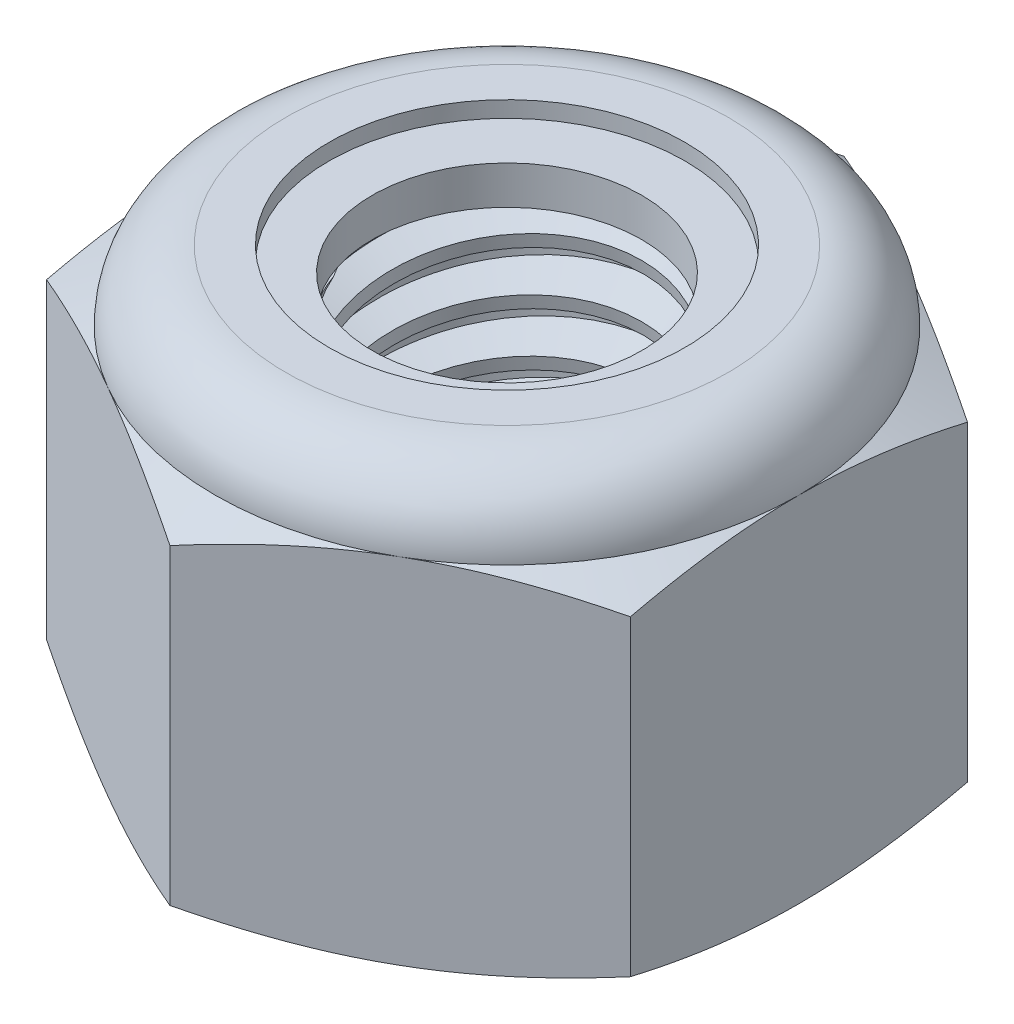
from build123d import *

# Parameters (mm, degrees)
EXTRUDE1_DEPTH      = 4
SKETCH2_W           = 1.5
SKETCH2_H           = 4
LPATTERN1_COUNT     = 8
LPATTERN1_PITCH     = 0.5
LPATTERN1_COL_COUNT = 2
LPATTERN1_COL_PITCH = 0.5


with BuildPart() as part:
    # Sketch1 → Extrude1 (new body)
    with BuildSketch(Plane(origin=(0, 0, 0), x_dir=(1, 0, 0), z_dir=(0, 1, 0))):
        Polygon((0, 3.175426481), (-2.75, 1.58771324), (-2.75, -1.58771324), (0, -3.175426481), (2.75, -1.58771324), (2.75, 1.58771324), align=None)
    extrude(amount=EXTRUDE1_DEPTH)

    # Sketch4 → Cut-Revolve2 (revolve, cut)
    with BuildSketch(Plane(origin=(0, 0, 0), x_dir=(0, 0, -1), z_dir=(1, 0, 0)), mode=Mode.PRIVATE) as cut_revolve2_sk:
        Polygon((0, 4), (1.5, 4), (1.269011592, 3.892288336), (1.269011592, 0.107711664), (1.5, 0), (0, 0), align=None)
    revolve(cut_revolve2_sk.sketch.rotate(Axis((0, 4, 0), (0, 1, 0)), 55.157981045), axis=Axis((0, 4, 0), (0, 1, 0)), mode=Mode.SUBTRACT)


with BuildPart() as body_2:
    # Sketch2 → Revolve1 (revolve)
    with BuildSketch(Plane(origin=(0, 0, 0), x_dir=(0, 0, -1), z_dir=(1, 0, 0))):
        with Locations((0.75, 2)):
            Rectangle(SKETCH2_W, SKETCH2_H)
    revolve(axis=Axis((0, -1.5, 0), (0, 1, 0)))

    # Sketch3 → Cut-Revolve1 (revolve, cut)
    with BuildSketch(Plane(origin=(0, 0, 0), x_dir=(0, 0, -1), z_dir=(1, 0, 0)), mode=Mode.PRIVATE) as cut_revolve1_sk:
        Polygon((1.510274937, 3.93835038), (1.582199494, 3.506803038), (1.289561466, 3.616435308), (1.269011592, 3.739734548), align=None)
    cut_revolve1 = revolve(cut_revolve1_sk.sketch.rotate(Axis((0, 4, 0.089188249), (0, -0.9863939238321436, -0.1643989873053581)), 180), axis=Axis((0, 4, 0.089188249), (0, -0.9863939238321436, -0.1643989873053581)), mode=Mode.SUBTRACT)

    # LPattern1: Cut-Revolve1 ×8
    with Locations(*[(0, -i * LPATTERN1_PITCH, 0) for i in range(1, LPATTERN1_COUNT)]):
        add(cut_revolve1, mode=Mode.SUBTRACT)

    # LPattern1 col: Cut-Revolve1 ×2
    with Locations(*[(0, i * LPATTERN1_COL_PITCH, 0) for i in range(1, LPATTERN1_COL_COUNT)]):
        add(cut_revolve1, mode=Mode.SUBTRACT)


with BuildPart() as part_1:
    add(part.part)

    # Combine1: cut body 2
    add(body_2.part, mode=Mode.SUBTRACT)

    # Sketch5 → Cut-Revolve3 (revolve, cut)
    with BuildSketch(Plane(origin=(0, 0, 0), x_dir=(0, 0, -1), z_dir=(1, 0, 0)), mode=Mode.PRIVATE) as cut_revolve3_sk:
        with BuildLine():
            Line((0, 0), (2.75, 0))
            Line((2.75, 0), (3.175426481, 0.198379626))
            Line((3.175426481, 0.198379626), (3.175426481, 3.134953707))
            Line((3.175426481, 3.134953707), (2.75, 3.333333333))
            ThreePointArc((2.75, 3.333333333), (2.554737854, 3.804737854), (2.083333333, 4))
            Line((2.083333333, 4), (2.083333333, 5.27))
            Line((2.083333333, 5.27), (4.445426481, 5.27))
            Line((4.445426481, 5.27), (4.445426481, -1.27))
            Line((4.445426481, -1.27), (0, -1.27))
            Line((0, -1.27), (0, 0))
        make_face()
    revolve(cut_revolve3_sk.sketch.rotate(Axis((0, 0, 0), (0, 1, 0)), 55.157981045), axis=Axis((0, 0, 0), (0, 1, 0)), mode=Mode.SUBTRACT)

    # Sketch6 → Cut-Revolve4 (revolve, cut)
    with BuildSketch(Plane(origin=(0, 0, 0), x_dir=(0, 0, -1), z_dir=(1, 0, 0)), mode=Mode.PRIVATE) as cut_revolve4_sk:
        with BuildLine():
            Line((0, 3.333333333), (2.5976, 3.333333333))
            ThreePointArc((2.5976, 3.333333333), (2.446974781, 3.696974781), (2.083333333, 3.8476))
            Line((2.083333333, 3.8476), (1.676172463, 3.8476))
            Line((1.676172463, 3.8476), (1.676172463, 5.27))
            Line((1.676172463, 5.27), (0, 5.27))
            Line((0, 5.27), (0, 3.333333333))
        make_face()
    revolve(cut_revolve4_sk.sketch.rotate(Axis((0, 5.27, 0), (0, 1, 0)), 55.157981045), axis=Axis((0, 5.27, 0), (0, 1, 0)), mode=Mode.SUBTRACT)


with BuildPart() as body_2_2:
    # Sketch7 → Revolve2 (revolve)
    with BuildSketch(Plane(origin=(0, 0, 0), x_dir=(0, 0, -1), z_dir=(1, 0, 0))):
        with BuildLine():
            Line((1.269011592, 3.409533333), (2.514721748, 3.409533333))
            ThreePointArc((2.514721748, 3.409533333), (2.36486639, 3.668954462), (2.083333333, 3.7714))
            Line((2.083333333, 3.7714), (1.269011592, 3.7714))
            Line((1.269011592, 3.7714), (1.269011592, 3.409533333))
        make_face()
    revolve(axis=Axis((0, 3.409533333, 0), (0, 1, 0)))


solid = Compound([part_1.part, body_2_2.part])
